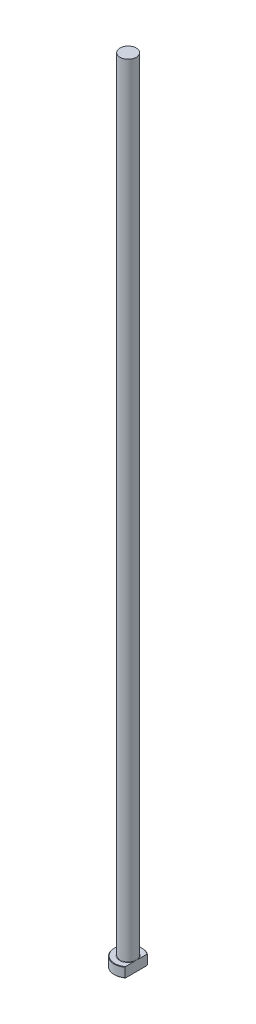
from build123d import *
from build123d.topology import SkipClean

# Parameters (mm, degrees)
CHAMFER1_SIZE = 0.2
FILLET1_R     = 0.2
KEY_DEPTH     = 401.122481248


with BuildPart() as part:
    # Sketch1 → Revolve1 (revolve)
    with BuildSketch(Plane.XY, mode=Mode.PRIVATE) as revolve1_sk:
        Polygon((0, 0), (-7, 0), (-7, 5), (-4.1, 5), (-4.1, 400), (0, 400), align=None)
    revolve(revolve1_sk.sketch.rotate(Axis((0, 259.958771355, 0), (0, -1, 0)), 270), axis=Axis((0, 259.958771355, 0), (0, -1, 0)))

    # Chamfer1
    chamfer1_edges = [part.edges().sort_by_distance(p)[0] for p in [
        (0, 5, -7),
        (0, 0, -7),
    ]]
    chamfer(chamfer1_edges, length=CHAMFER1_SIZE)

    # Fillet1
    fillet1_edges = [part.edges().sort_by_distance(p)[0] for p in [
        (0, 5, -4.1),
    ]]
    fillet(fillet1_edges, radius=FILLET1_R)

    # Sketch2 → KEY (cut, through all)
    with SkipClean():  # the faces are left unmerged after this step: merging them gives an invalid solid
        with BuildSketch(Plane(origin=(0, 0, 0), x_dir=(1, 0, 0), z_dir=(0, 1, 0))):
            with BuildLine():
                Line((4.1, 5.673623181), (4.1, -5.673623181))
                ThreePointArc((4.1, -5.673623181), (7, 0), (4.1, 5.673623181))
            make_face()
        extrude(amount=KEY_DEPTH, mode=Mode.SUBTRACT)


solid = part.part
